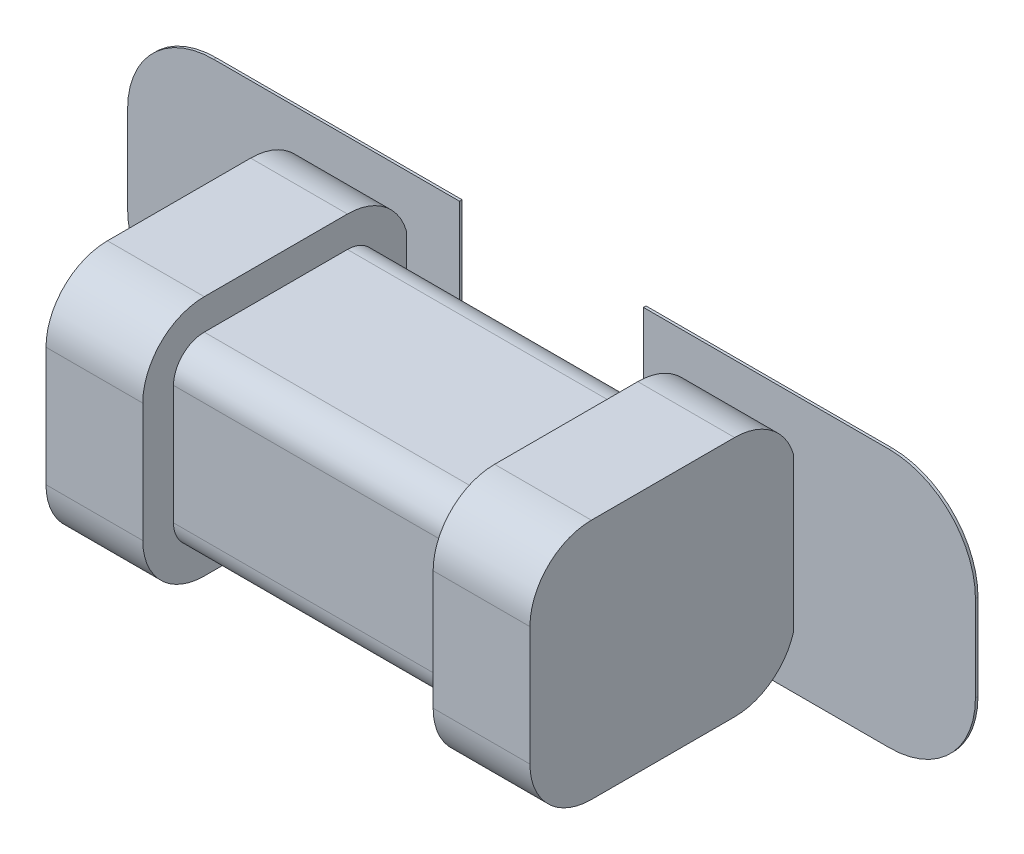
ISO-10303-21;
HEADER;
FILE_DESCRIPTION(('STEP AP214'),'2;1');
FILE_NAME('part.step','',(''),(''),'','','');
FILE_SCHEMA(('AUTOMOTIVE_DESIGN { 1 0 10303 214 1 1 1 1 }'));
ENDSEC;
DATA;
#1=APPLICATION_CONTEXT('core data for automotive mechanical design processes');
#2=APPLICATION_PROTOCOL_DEFINITION('international standard','automotive_design',2000,#1);
#3=PRODUCT_CONTEXT('',#1,'mechanical');
#4=PRODUCT('Part','Part','',(#3));
#5=PRODUCT_RELATED_PRODUCT_CATEGORY('part','',(#4));
#6=PRODUCT_DEFINITION_FORMATION('','',#4);
#7=PRODUCT_DEFINITION_CONTEXT('part definition',#1,'design');
#8=PRODUCT_DEFINITION('design','',#6,#7);
#9=PRODUCT_DEFINITION_SHAPE('','',#8);
#10=(LENGTH_UNIT() NAMED_UNIT(*) SI_UNIT(.MILLI.,.METRE.));
#11=(NAMED_UNIT(*) PLANE_ANGLE_UNIT() SI_UNIT($,.RADIAN.));
#12=(NAMED_UNIT(*) SI_UNIT($,.STERADIAN.) SOLID_ANGLE_UNIT());
#13=UNCERTAINTY_MEASURE_WITH_UNIT(LENGTH_MEASURE(1.E-05),#10,'distance_accuracy_value','');
#14=(GEOMETRIC_REPRESENTATION_CONTEXT(3) GLOBAL_UNCERTAINTY_ASSIGNED_CONTEXT((#13)) GLOBAL_UNIT_ASSIGNED_CONTEXT((#10,
#11,#12)) REPRESENTATION_CONTEXT('',''));
#15=CARTESIAN_POINT('',(0.,0.,0.));
#16=DIRECTION('',(0.,0.,1.));
#17=DIRECTION('',(1.,0.,0.));
#18=AXIS2_PLACEMENT_3D('',#15,#16,#17);
#19=CARTESIAN_POINT('',(0.,0.,0.0762));
#20=DIRECTION('',(0.,0.,1.));
#21=DIRECTION('',(1.,0.,0.));
#22=AXIS2_PLACEMENT_3D('',#19,#20,#21);
#23=PLANE('',#22);
#24=CARTESIAN_POINT('',(-0.698058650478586,-0.0890682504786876,0.0762));
#25=DIRECTION('',(0.,0.,1.));
#26=DIRECTION('',(1.,0.,0.));
#27=AXIS2_PLACEMENT_3D('',#24,#25,#26);
#28=CIRCLE('',#27,0.177936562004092);
#29=CARTESIAN_POINT('',(-0.875995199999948,-0.0890016,0.0762));
#30=VERTEX_POINT('',#29);
#31=CARTESIAN_POINT('',(-0.697992,-0.267004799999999,0.0762));
#32=VERTEX_POINT('',#31);
#33=EDGE_CURVE('E268',#30,#32,#28,.T.);
#34=ORIENTED_EDGE('',*,*,#33,.F.);
#35=DIRECTION('',(0.,1.,0.));
#36=VECTOR('',#35,1.);
#37=CARTESIAN_POINT('',(-0.8759952,0.0890016,0.0762));
#38=LINE('',#37,#36);
#39=CARTESIAN_POINT('',(-0.875995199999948,0.0890016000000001,0.0762));
#40=VERTEX_POINT('',#39);
#41=EDGE_CURVE('E262',#40,#30,#38,.F.);
#42=ORIENTED_EDGE('',*,*,#41,.F.);
#43=CARTESIAN_POINT('',(-0.698058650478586,0.0890682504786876,0.0762));
#44=DIRECTION('',(0.,0.,1.));
#45=DIRECTION('',(1.,0.,0.));
#46=AXIS2_PLACEMENT_3D('',#43,#44,#45);
#47=CIRCLE('',#46,0.177936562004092);
#48=CARTESIAN_POINT('',(-0.697992,0.267004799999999,0.0762));
#49=VERTEX_POINT('',#48);
#50=EDGE_CURVE('E19',#49,#40,#47,.T.);
#51=ORIENTED_EDGE('',*,*,#50,.F.);
#52=DIRECTION('',(1.,0.,0.));
#53=VECTOR('',#52,1.);
#54=CARTESIAN_POINT('',(-0.189992,0.2670048,0.0762));
#55=LINE('',#54,#53);
#56=CARTESIAN_POINT('',(-0.189992,0.2670048,0.0762));
#57=VERTEX_POINT('',#56);
#58=EDGE_CURVE('E245',#57,#49,#55,.F.);
#59=ORIENTED_EDGE('',*,*,#58,.F.);
#60=DIRECTION('',(0.,1.,0.));
#61=VECTOR('',#60,1.);
#62=CARTESIAN_POINT('',(-0.189992,-0.2670048,0.0762));
#63=LINE('',#62,#61);
#64=CARTESIAN_POINT('',(-0.189992,-0.2670048,0.0762));
#65=VERTEX_POINT('',#64);
#66=EDGE_CURVE('E408',#65,#57,#63,.T.);
#67=ORIENTED_EDGE('',*,*,#66,.F.);
#68=DIRECTION('',(1.,0.,0.));
#69=VECTOR('',#68,1.);
#70=CARTESIAN_POINT('',(-0.697992,-0.2670048,0.0762));
#71=LINE('',#70,#69);
#72=EDGE_CURVE('E395',#32,#65,#71,.T.);
#73=ORIENTED_EDGE('',*,*,#72,.F.);
#74=EDGE_LOOP('',(#34,#42,#51,#59,#67,#73));
#75=FACE_BOUND('',#74,.T.);
#76=ADVANCED_FACE('F16',(#75),#23,.F.);
#77=CARTESIAN_POINT('',(-0.189992,0.2670048,0.0762));
#78=DIRECTION('',(0.,1.,0.));
#79=DIRECTION('',(0.,0.,1.));
#80=AXIS2_PLACEMENT_3D('',#77,#78,#79);
#81=PLANE('',#80);
#82=DIRECTION('',(0.,0.,-1.));
#83=VECTOR('',#82,1.);
#84=CARTESIAN_POINT('',(-0.189992,0.2670048,0.0762));
#85=LINE('',#84,#83);
#86=CARTESIAN_POINT('',(-0.189992,0.2670048,0.081534));
#87=VERTEX_POINT('',#86);
#88=EDGE_CURVE('E399',#57,#87,#85,.F.);
#89=ORIENTED_EDGE('',*,*,#88,.F.);
#90=ORIENTED_EDGE('',*,*,#58,.T.);
#91=DIRECTION('',(0.,0.,1.));
#92=VECTOR('',#91,1.);
#93=CARTESIAN_POINT('',(-0.697992,0.267004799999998,0.0762));
#94=LINE('',#93,#92);
#95=CARTESIAN_POINT('',(-0.697992,0.267004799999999,0.081534));
#96=VERTEX_POINT('',#95);
#97=EDGE_CURVE('E256',#96,#49,#94,.F.);
#98=ORIENTED_EDGE('',*,*,#97,.F.);
#99=DIRECTION('',(1.,0.,0.));
#100=VECTOR('',#99,1.);
#101=CARTESIAN_POINT('',(0.,0.2670048,0.081534));
#102=LINE('',#101,#100);
#103=EDGE_CURVE('E390',#87,#96,#102,.F.);
#104=ORIENTED_EDGE('',*,*,#103,.F.);
#105=EDGE_LOOP('',(#89,#90,#98,#104));
#106=FACE_BOUND('',#105,.T.);
#107=ADVANCED_FACE('F457',(#106),#81,.T.);
#108=CARTESIAN_POINT('',(-0.698058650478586,0.0890682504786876,0.0762));
#109=DIRECTION('',(0.,0.,1.));
#110=DIRECTION('',(1.,0.,0.));
#111=AXIS2_PLACEMENT_3D('',#108,#109,#110);
#112=CYLINDRICAL_SURFACE('',#111,0.177936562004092);
#113=ORIENTED_EDGE('',*,*,#97,.T.);
#114=ORIENTED_EDGE('',*,*,#50,.T.);
#115=DIRECTION('',(0.,0.,1.));
#116=VECTOR('',#115,1.);
#117=CARTESIAN_POINT('',(-0.8759952,0.0890016,0.0762));
#118=LINE('',#117,#116);
#119=CARTESIAN_POINT('',(-0.875995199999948,0.0890016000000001,0.081534));
#120=VERTEX_POINT('',#119);
#121=EDGE_CURVE('E254',#120,#40,#118,.F.);
#122=ORIENTED_EDGE('',*,*,#121,.F.);
#123=CARTESIAN_POINT('',(-0.698058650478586,0.0890682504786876,0.081534));
#124=DIRECTION('',(0.,0.,1.));
#125=DIRECTION('',(1.,0.,0.));
#126=AXIS2_PLACEMENT_3D('',#123,#124,#125);
#127=CIRCLE('',#126,0.177936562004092);
#128=EDGE_CURVE('E389',#96,#120,#127,.T.);
#129=ORIENTED_EDGE('',*,*,#128,.F.);
#130=EDGE_LOOP('',(#113,#114,#122,#129));
#131=FACE_BOUND('',#130,.T.);
#132=ADVANCED_FACE('F252',(#131),#112,.T.);
#133=CARTESIAN_POINT('',(-0.8759952,0.0890016,0.0762));
#134=DIRECTION('',(-1.,0.,0.));
#135=DIRECTION('',(0.,0.,1.));
#136=AXIS2_PLACEMENT_3D('',#133,#134,#135);
#137=PLANE('',#136);
#138=ORIENTED_EDGE('',*,*,#121,.T.);
#139=ORIENTED_EDGE('',*,*,#41,.T.);
#140=DIRECTION('',(0.,0.,1.));
#141=VECTOR('',#140,1.);
#142=CARTESIAN_POINT('',(-0.875995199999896,-0.0890016,0.0762));
#143=LINE('',#142,#141);
#144=CARTESIAN_POINT('',(-0.875995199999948,-0.0890016,0.081534));
#145=VERTEX_POINT('',#144);
#146=EDGE_CURVE('E269',#145,#30,#143,.F.);
#147=ORIENTED_EDGE('',*,*,#146,.F.);
#148=DIRECTION('',(0.,1.,0.));
#149=VECTOR('',#148,1.);
#150=CARTESIAN_POINT('',(-0.8759952,0.,0.081534));
#151=LINE('',#150,#149);
#152=EDGE_CURVE('E264',#120,#145,#151,.F.);
#153=ORIENTED_EDGE('',*,*,#152,.F.);
#154=EDGE_LOOP('',(#138,#139,#147,#153));
#155=FACE_BOUND('',#154,.T.);
#156=ADVANCED_FACE('F260',(#155),#137,.T.);
#157=CARTESIAN_POINT('',(-0.698058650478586,-0.0890682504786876,0.0762));
#158=DIRECTION('',(0.,0.,1.));
#159=DIRECTION('',(1.,0.,0.));
#160=AXIS2_PLACEMENT_3D('',#157,#158,#159);
#161=CYLINDRICAL_SURFACE('',#160,0.177936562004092);
#162=ORIENTED_EDGE('',*,*,#146,.T.);
#163=ORIENTED_EDGE('',*,*,#33,.T.);
#164=DIRECTION('',(0.,0.,-1.));
#165=VECTOR('',#164,1.);
#166=CARTESIAN_POINT('',(-0.697992,-0.2670048,0.0762));
#167=LINE('',#166,#165);
#168=CARTESIAN_POINT('',(-0.697992,-0.267004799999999,0.081534));
#169=VERTEX_POINT('',#168);
#170=EDGE_CURVE('E391',#169,#32,#167,.T.);
#171=ORIENTED_EDGE('',*,*,#170,.F.);
#172=CARTESIAN_POINT('',(-0.698058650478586,-0.0890682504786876,0.081534));
#173=DIRECTION('',(0.,0.,1.));
#174=DIRECTION('',(1.,0.,0.));
#175=AXIS2_PLACEMENT_3D('',#172,#173,#174);
#176=CIRCLE('',#175,0.177936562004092);
#177=EDGE_CURVE('E386',#145,#169,#176,.T.);
#178=ORIENTED_EDGE('',*,*,#177,.F.);
#179=EDGE_LOOP('',(#162,#163,#171,#178));
#180=FACE_BOUND('',#179,.T.);
#181=ADVANCED_FACE('F458',(#180),#161,.T.);
#182=CARTESIAN_POINT('',(-0.697992,-0.2670048,0.0762));
#183=DIRECTION('',(0.,-1.,0.));
#184=DIRECTION('',(0.,0.,-1.));
#185=AXIS2_PLACEMENT_3D('',#182,#183,#184);
#186=PLANE('',#185);
#187=ORIENTED_EDGE('',*,*,#170,.T.);
#188=ORIENTED_EDGE('',*,*,#72,.T.);
#189=DIRECTION('',(0.,0.,-1.));
#190=VECTOR('',#189,1.);
#191=CARTESIAN_POINT('',(-0.189992,-0.2670048,0.0762));
#192=LINE('',#191,#190);
#193=CARTESIAN_POINT('',(-0.189992,-0.2670048,0.081534));
#194=VERTEX_POINT('',#193);
#195=EDGE_CURVE('E405',#194,#65,#192,.T.);
#196=ORIENTED_EDGE('',*,*,#195,.F.);
#197=DIRECTION('',(1.,0.,0.));
#198=VECTOR('',#197,1.);
#199=CARTESIAN_POINT('',(0.,-0.2670048,0.081534));
#200=LINE('',#199,#198);
#201=EDGE_CURVE('E388',#169,#194,#200,.T.);
#202=ORIENTED_EDGE('',*,*,#201,.F.);
#203=EDGE_LOOP('',(#187,#188,#196,#202));
#204=FACE_BOUND('',#203,.T.);
#205=ADVANCED_FACE('F455',(#204),#186,.T.);
#206=CARTESIAN_POINT('',(-0.189992,-0.2670048,0.0762));
#207=DIRECTION('',(1.,0.,0.));
#208=DIRECTION('',(0.,0.,-1.));
#209=AXIS2_PLACEMENT_3D('',#206,#207,#208);
#210=PLANE('',#209);
#211=ORIENTED_EDGE('',*,*,#195,.T.);
#212=ORIENTED_EDGE('',*,*,#66,.T.);
#213=ORIENTED_EDGE('',*,*,#88,.T.);
#214=DIRECTION('',(0.,1.,0.));
#215=VECTOR('',#214,1.);
#216=CARTESIAN_POINT('',(-0.189992,0.,0.081534));
#217=LINE('',#216,#215);
#218=EDGE_CURVE('E411',#194,#87,#217,.T.);
#219=ORIENTED_EDGE('',*,*,#218,.F.);
#220=EDGE_LOOP('',(#211,#212,#213,#219));
#221=FACE_BOUND('',#220,.T.);
#222=ADVANCED_FACE('F456',(#221),#210,.T.);
#223=CARTESIAN_POINT('',(-0.500000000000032,0.249999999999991,0.0762));
#224=DIRECTION('',(-1.,0.,0.));
#225=DIRECTION('',(0.,0.,1.));
#226=AXIS2_PLACEMENT_3D('',#223,#224,#225);
#227=PLANE('',#226);
#228=CARTESIAN_POINT('',(-0.500000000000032,0.122999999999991,0.2032));
#229=DIRECTION('',(1.,0.,0.));
#230=DIRECTION('',(0.,0.,-1.));
#231=AXIS2_PLACEMENT_3D('',#228,#229,#230);
#232=CIRCLE('',#231,0.127);
#233=CARTESIAN_POINT('',(-0.500000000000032,0.15941956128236,0.0815340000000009));
#234=VERTEX_POINT('',#233);
#235=CARTESIAN_POINT('',(-0.500000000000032,0.249999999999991,0.2032));
#236=VERTEX_POINT('',#235);
#237=EDGE_CURVE('E369',#234,#236,#232,.T.);
#238=ORIENTED_EDGE('',*,*,#237,.F.);
#239=DIRECTION('',(0.,1.,0.));
#240=VECTOR('',#239,1.);
#241=CARTESIAN_POINT('',(-0.500000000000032,0.,0.081534));
#242=LINE('',#241,#240);
#243=CARTESIAN_POINT('',(-0.500000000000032,-0.15941956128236,0.0815340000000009));
#244=VERTEX_POINT('',#243);
#245=EDGE_CURVE('E385',#244,#234,#242,.T.);
#246=ORIENTED_EDGE('',*,*,#245,.F.);
#247=CARTESIAN_POINT('',(-0.500000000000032,-0.122999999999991,0.2032));
#248=DIRECTION('',(1.,0.,0.));
#249=DIRECTION('',(0.,0.,-1.));
#250=AXIS2_PLACEMENT_3D('',#247,#248,#249);
#251=CIRCLE('',#250,0.127);
#252=CARTESIAN_POINT('',(-0.500000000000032,-0.249999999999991,0.2032));
#253=VERTEX_POINT('',#252);
#254=EDGE_CURVE('E382',#253,#244,#251,.T.);
#255=ORIENTED_EDGE('',*,*,#254,.F.);
#256=DIRECTION('',(0.,0.,-1.));
#257=VECTOR('',#256,1.);
#258=CARTESIAN_POINT('',(-0.500000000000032,-0.249999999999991,0.0762));
#259=LINE('',#258,#257);
#260=CARTESIAN_POINT('',(-0.500000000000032,-0.249999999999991,0.49911));
#261=VERTEX_POINT('',#260);
#262=EDGE_CURVE('E403',#261,#253,#259,.T.);
#263=ORIENTED_EDGE('',*,*,#262,.F.);
#264=CARTESIAN_POINT('',(-0.500000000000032,-0.122999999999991,0.49911));
#265=DIRECTION('',(1.,0.,0.));
#266=DIRECTION('',(0.,0.,-1.));
#267=AXIS2_PLACEMENT_3D('',#264,#265,#266);
#268=CIRCLE('',#267,0.127);
#269=CARTESIAN_POINT('',(-0.500000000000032,-0.122999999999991,0.62611));
#270=VERTEX_POINT('',#269);
#271=EDGE_CURVE('E378',#270,#261,#268,.T.);
#272=ORIENTED_EDGE('',*,*,#271,.F.);
#273=DIRECTION('',(0.,1.,0.));
#274=VECTOR('',#273,1.);
#275=CARTESIAN_POINT('',(-0.500000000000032,0.,0.62611));
#276=LINE('',#275,#274);
#277=CARTESIAN_POINT('',(-0.500000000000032,0.122999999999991,0.62611));
#278=VERTEX_POINT('',#277);
#279=EDGE_CURVE('E436',#278,#270,#276,.F.);
#280=ORIENTED_EDGE('',*,*,#279,.F.);
#281=CARTESIAN_POINT('',(-0.500000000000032,0.122999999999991,0.49911));
#282=DIRECTION('',(-1.,0.,0.));
#283=DIRECTION('',(0.,0.,1.));
#284=AXIS2_PLACEMENT_3D('',#281,#282,#283);
#285=CIRCLE('',#284,0.127);
#286=CARTESIAN_POINT('',(-0.500000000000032,0.249999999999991,0.49911));
#287=VERTEX_POINT('',#286);
#288=EDGE_CURVE('E373',#287,#278,#285,.F.);
#289=ORIENTED_EDGE('',*,*,#288,.F.);
#290=DIRECTION('',(0.,0.,1.));
#291=VECTOR('',#290,1.);
#292=CARTESIAN_POINT('',(-0.500000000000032,0.249999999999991,0.0762));
#293=LINE('',#292,#291);
#294=EDGE_CURVE('E376',#236,#287,#293,.T.);
#295=ORIENTED_EDGE('',*,*,#294,.F.);
#296=EDGE_LOOP('',(#238,#246,#255,#263,#272,#280,#289,#295));
#297=FACE_BOUND('',#296,.T.);
#298=ADVANCED_FACE('F603',(#297),#227,.T.);
#299=CARTESIAN_POINT('',(0.,0.,0.081534));
#300=DIRECTION('',(0.,0.,1.));
#301=DIRECTION('',(1.,0.,0.));
#302=AXIS2_PLACEMENT_3D('',#299,#300,#301);
#303=PLANE('',#302);
#304=DIRECTION('',(1.,0.,0.));
#305=VECTOR('',#304,1.);
#306=CARTESIAN_POINT('',(0.500000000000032,-0.159419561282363,0.0815340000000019));
#307=LINE('',#306,#305);
#308=CARTESIAN_POINT('',(-0.30000000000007,-0.15941956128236,0.0815340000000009));
#309=VERTEX_POINT('',#308);
#310=EDGE_CURVE('E384',#244,#309,#307,.T.);
#311=ORIENTED_EDGE('',*,*,#310,.F.);
#312=ORIENTED_EDGE('',*,*,#245,.T.);
#313=DIRECTION('',(1.,0.,0.));
#314=VECTOR('',#313,1.);
#315=CARTESIAN_POINT('',(0.500000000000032,0.159419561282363,0.0815340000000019));
#316=LINE('',#315,#314);
#317=CARTESIAN_POINT('',(-0.30000000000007,0.15941956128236,0.0815340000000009));
#318=VERTEX_POINT('',#317);
#319=EDGE_CURVE('E950',#318,#234,#316,.F.);
#320=ORIENTED_EDGE('',*,*,#319,.F.);
#321=DIRECTION('',(0.,1.,0.));
#322=VECTOR('',#321,1.);
#323=CARTESIAN_POINT('',(-0.30000000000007,0.249999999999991,0.081534));
#324=LINE('',#323,#322);
#325=EDGE_CURVE('E368',#318,#309,#324,.F.);
#326=ORIENTED_EDGE('',*,*,#325,.T.);
#327=EDGE_LOOP('',(#311,#312,#320,#326));
#328=FACE_BOUND('',#327,.T.);
#329=ORIENTED_EDGE('',*,*,#201,.T.);
#330=ORIENTED_EDGE('',*,*,#218,.T.);
#331=ORIENTED_EDGE('',*,*,#103,.T.);
#332=ORIENTED_EDGE('',*,*,#128,.T.);
#333=ORIENTED_EDGE('',*,*,#152,.T.);
#334=ORIENTED_EDGE('',*,*,#177,.T.);
#335=EDGE_LOOP('',(#329,#330,#331,#332,#333,#334));
#336=FACE_BOUND('',#335,.T.);
#337=ADVANCED_FACE('F452',(#328,#336),#303,.T.);
#338=CARTESIAN_POINT('',(0.500000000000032,-0.122999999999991,0.2032));
#339=DIRECTION('',(1.,0.,0.));
#340=DIRECTION('',(0.,0.,-1.));
#341=AXIS2_PLACEMENT_3D('',#338,#339,#340);
#342=CYLINDRICAL_SURFACE('',#341,0.127);
#343=ORIENTED_EDGE('',*,*,#254,.T.);
#344=ORIENTED_EDGE('',*,*,#310,.T.);
#345=CARTESIAN_POINT('',(-0.30000000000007,-0.122999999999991,0.2032));
#346=DIRECTION('',(1.,0.,0.));
#347=DIRECTION('',(0.,0.,-1.));
#348=AXIS2_PLACEMENT_3D('',#345,#346,#347);
#349=CIRCLE('',#348,0.127);
#350=CARTESIAN_POINT('',(-0.30000000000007,-0.249999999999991,0.2032));
#351=VERTEX_POINT('',#350);
#352=EDGE_CURVE('E365',#309,#351,#349,.F.);
#353=ORIENTED_EDGE('',*,*,#352,.T.);
#354=DIRECTION('',(1.,0.,0.));
#355=VECTOR('',#354,1.);
#356=CARTESIAN_POINT('',(-0.500000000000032,-0.249999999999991,0.2032));
#357=LINE('',#356,#355);
#358=EDGE_CURVE('E381',#253,#351,#357,.T.);
#359=ORIENTED_EDGE('',*,*,#358,.F.);
#360=EDGE_LOOP('',(#343,#344,#353,#359));
#361=FACE_BOUND('',#360,.T.);
#362=ADVANCED_FACE('F596',(#361),#342,.T.);
#363=CARTESIAN_POINT('',(-0.500000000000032,-0.249999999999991,0.0762));
#364=DIRECTION('',(0.,-1.,0.));
#365=DIRECTION('',(0.,0.,-1.));
#366=AXIS2_PLACEMENT_3D('',#363,#364,#365);
#367=PLANE('',#366);
#368=ORIENTED_EDGE('',*,*,#262,.T.);
#369=ORIENTED_EDGE('',*,*,#358,.T.);
#370=DIRECTION('',(0.,0.,1.));
#371=VECTOR('',#370,1.);
#372=CARTESIAN_POINT('',(-0.30000000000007,-0.249999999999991,0.0762));
#373=LINE('',#372,#371);
#374=CARTESIAN_POINT('',(-0.30000000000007,-0.249999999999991,0.49911));
#375=VERTEX_POINT('',#374);
#376=EDGE_CURVE('E364',#351,#375,#373,.T.);
#377=ORIENTED_EDGE('',*,*,#376,.T.);
#378=DIRECTION('',(1.,0.,0.));
#379=VECTOR('',#378,1.);
#380=CARTESIAN_POINT('',(-0.503674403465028,-0.249999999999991,0.49911));
#381=LINE('',#380,#379);
#382=EDGE_CURVE('E380',#261,#375,#381,.T.);
#383=ORIENTED_EDGE('',*,*,#382,.F.);
#384=EDGE_LOOP('',(#368,#369,#377,#383));
#385=FACE_BOUND('',#384,.T.);
#386=ADVANCED_FACE('F593',(#385),#367,.T.);
#387=CARTESIAN_POINT('',(-0.503674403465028,-0.122999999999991,0.49911));
#388=DIRECTION('',(1.,0.,0.));
#389=DIRECTION('',(0.,0.,-1.));
#390=AXIS2_PLACEMENT_3D('',#387,#388,#389);
#391=CYLINDRICAL_SURFACE('',#390,0.127);
#392=ORIENTED_EDGE('',*,*,#382,.T.);
#393=CARTESIAN_POINT('',(-0.30000000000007,-0.122999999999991,0.49911));
#394=DIRECTION('',(1.,0.,0.));
#395=DIRECTION('',(0.,0.,-1.));
#396=AXIS2_PLACEMENT_3D('',#393,#394,#395);
#397=CIRCLE('',#396,0.127);
#398=CARTESIAN_POINT('',(-0.30000000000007,-0.122999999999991,0.62611));
#399=VERTEX_POINT('',#398);
#400=EDGE_CURVE('E361',#375,#399,#397,.F.);
#401=ORIENTED_EDGE('',*,*,#400,.T.);
#402=DIRECTION('',(1.,0.,0.));
#403=VECTOR('',#402,1.);
#404=CARTESIAN_POINT('',(0.,-0.122999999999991,0.62611));
#405=LINE('',#404,#403);
#406=EDGE_CURVE('E437',#270,#399,#405,.T.);
#407=ORIENTED_EDGE('',*,*,#406,.F.);
#408=ORIENTED_EDGE('',*,*,#271,.T.);
#409=EDGE_LOOP('',(#392,#401,#407,#408));
#410=FACE_BOUND('',#409,.T.);
#411=ADVANCED_FACE('F590',(#410),#391,.T.);
#412=CARTESIAN_POINT('',(0.,0.,0.62611));
#413=DIRECTION('',(0.,0.,1.));
#414=DIRECTION('',(1.,0.,0.));
#415=AXIS2_PLACEMENT_3D('',#412,#413,#414);
#416=PLANE('',#415);
#417=DIRECTION('',(0.,1.,0.));
#418=VECTOR('',#417,1.);
#419=CARTESIAN_POINT('',(-0.30000000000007,0.249999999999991,0.62611));
#420=LINE('',#419,#418);
#421=CARTESIAN_POINT('',(-0.30000000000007,0.122999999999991,0.62611));
#422=VERTEX_POINT('',#421);
#423=EDGE_CURVE('E360',#399,#422,#420,.T.);
#424=ORIENTED_EDGE('',*,*,#423,.T.);
#425=DIRECTION('',(-1.,0.,0.));
#426=VECTOR('',#425,1.);
#427=CARTESIAN_POINT('',(0.503533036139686,0.122999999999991,0.62611));
#428=LINE('',#427,#426);
#429=EDGE_CURVE('E377',#278,#422,#428,.F.);
#430=ORIENTED_EDGE('',*,*,#429,.F.);
#431=ORIENTED_EDGE('',*,*,#279,.T.);
#432=ORIENTED_EDGE('',*,*,#406,.T.);
#433=EDGE_LOOP('',(#424,#430,#431,#432));
#434=FACE_BOUND('',#433,.T.);
#435=ADVANCED_FACE('F586',(#434),#416,.T.);
#436=CARTESIAN_POINT('',(0.503533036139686,0.122999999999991,0.49911));
#437=DIRECTION('',(-1.,0.,0.));
#438=DIRECTION('',(0.,0.,1.));
#439=AXIS2_PLACEMENT_3D('',#436,#437,#438);
#440=CYLINDRICAL_SURFACE('',#439,0.127);
#441=DIRECTION('',(1.,0.,0.));
#442=VECTOR('',#441,1.);
#443=CARTESIAN_POINT('',(0.500000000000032,0.249999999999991,0.49911));
#444=LINE('',#443,#442);
#445=CARTESIAN_POINT('',(-0.30000000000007,0.249999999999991,0.49911));
#446=VERTEX_POINT('',#445);
#447=EDGE_CURVE('E372',#287,#446,#444,.T.);
#448=ORIENTED_EDGE('',*,*,#447,.F.);
#449=ORIENTED_EDGE('',*,*,#288,.T.);
#450=ORIENTED_EDGE('',*,*,#429,.T.);
#451=CARTESIAN_POINT('',(-0.30000000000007,0.122999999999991,0.49911));
#452=DIRECTION('',(-1.,0.,0.));
#453=DIRECTION('',(0.,0.,1.));
#454=AXIS2_PLACEMENT_3D('',#451,#452,#453);
#455=CIRCLE('',#454,0.127);
#456=EDGE_CURVE('E357',#422,#446,#455,.T.);
#457=ORIENTED_EDGE('',*,*,#456,.T.);
#458=EDGE_LOOP('',(#448,#449,#450,#457));
#459=FACE_BOUND('',#458,.T.);
#460=ADVANCED_FACE('F582',(#459),#440,.T.);
#461=CARTESIAN_POINT('',(0.500000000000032,0.249999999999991,0.0762));
#462=DIRECTION('',(0.,1.,0.));
#463=DIRECTION('',(0.,0.,1.));
#464=AXIS2_PLACEMENT_3D('',#461,#462,#463);
#465=PLANE('',#464);
#466=DIRECTION('',(0.,0.,1.));
#467=VECTOR('',#466,1.);
#468=CARTESIAN_POINT('',(-0.30000000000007,0.249999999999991,0.0762));
#469=LINE('',#468,#467);
#470=CARTESIAN_POINT('',(-0.30000000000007,0.249999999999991,0.2032));
#471=VERTEX_POINT('',#470);
#472=EDGE_CURVE('E356',#446,#471,#469,.F.);
#473=ORIENTED_EDGE('',*,*,#472,.T.);
#474=DIRECTION('',(1.,0.,0.));
#475=VECTOR('',#474,1.);
#476=CARTESIAN_POINT('',(0.500000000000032,0.249999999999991,0.2032));
#477=LINE('',#476,#475);
#478=EDGE_CURVE('E371',#236,#471,#477,.T.);
#479=ORIENTED_EDGE('',*,*,#478,.F.);
#480=ORIENTED_EDGE('',*,*,#294,.T.);
#481=ORIENTED_EDGE('',*,*,#447,.T.);
#482=EDGE_LOOP('',(#473,#479,#480,#481));
#483=FACE_BOUND('',#482,.T.);
#484=ADVANCED_FACE('F578',(#483),#465,.T.);
#485=CARTESIAN_POINT('',(0.500000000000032,0.122999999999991,0.2032));
#486=DIRECTION('',(1.,0.,0.));
#487=DIRECTION('',(0.,0.,-1.));
#488=AXIS2_PLACEMENT_3D('',#485,#486,#487);
#489=CYLINDRICAL_SURFACE('',#488,0.127);
#490=CARTESIAN_POINT('',(-0.30000000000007,0.122999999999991,0.2032));
#491=DIRECTION('',(1.,0.,0.));
#492=DIRECTION('',(0.,0.,-1.));
#493=AXIS2_PLACEMENT_3D('',#490,#491,#492);
#494=CIRCLE('',#493,0.127);
#495=EDGE_CURVE('E353',#471,#318,#494,.F.);
#496=ORIENTED_EDGE('',*,*,#495,.T.);
#497=ORIENTED_EDGE('',*,*,#319,.T.);
#498=ORIENTED_EDGE('',*,*,#237,.T.);
#499=ORIENTED_EDGE('',*,*,#478,.T.);
#500=EDGE_LOOP('',(#496,#497,#498,#499));
#501=FACE_BOUND('',#500,.T.);
#502=ADVANCED_FACE('F574',(#501),#489,.T.);
#503=CARTESIAN_POINT('',(-0.30000000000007,0.249999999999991,0.0762));
#504=DIRECTION('',(-1.,0.,0.));
#505=DIRECTION('',(0.,0.,1.));
#506=AXIS2_PLACEMENT_3D('',#503,#504,#505);
#507=PLANE('',#506);
#508=DIRECTION('',(0.,1.,0.));
#509=VECTOR('',#508,1.);
#510=CARTESIAN_POINT('',(-0.30000000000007,0.249999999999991,0.1397));
#511=LINE('',#510,#509);
#512=CARTESIAN_POINT('',(-0.30000000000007,0.122999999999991,0.1397));
#513=VERTEX_POINT('',#512);
#514=CARTESIAN_POINT('',(-0.30000000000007,-0.122999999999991,0.1397));
#515=VERTEX_POINT('',#514);
#516=EDGE_CURVE('E344',#513,#515,#511,.F.);
#517=ORIENTED_EDGE('',*,*,#516,.T.);
#518=CARTESIAN_POINT('',(-0.30000000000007,-0.122999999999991,0.2032));
#519=DIRECTION('',(1.,0.,0.));
#520=DIRECTION('',(0.,0.,-1.));
#521=AXIS2_PLACEMENT_3D('',#518,#519,#520);
#522=CIRCLE('',#521,0.0635);
#523=CARTESIAN_POINT('',(-0.30000000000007,-0.186499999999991,0.2032));
#524=VERTEX_POINT('',#523);
#525=EDGE_CURVE('E341',#524,#515,#522,.T.);
#526=ORIENTED_EDGE('',*,*,#525,.F.);
#527=DIRECTION('',(0.,0.,1.));
#528=VECTOR('',#527,1.);
#529=CARTESIAN_POINT('',(-0.30000000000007,-0.186499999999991,0.0762));
#530=LINE('',#529,#528);
#531=CARTESIAN_POINT('',(-0.30000000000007,-0.186499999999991,0.49911));
#532=VERTEX_POINT('',#531);
#533=EDGE_CURVE('E340',#524,#532,#530,.T.);
#534=ORIENTED_EDGE('',*,*,#533,.T.);
#535=CARTESIAN_POINT('',(-0.30000000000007,-0.122999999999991,0.49911));
#536=DIRECTION('',(-1.,0.,0.));
#537=DIRECTION('',(0.,0.,1.));
#538=AXIS2_PLACEMENT_3D('',#535,#536,#537);
#539=CIRCLE('',#538,0.0635);
#540=CARTESIAN_POINT('',(-0.30000000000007,-0.122999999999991,0.56261));
#541=VERTEX_POINT('',#540);
#542=EDGE_CURVE('E337',#541,#532,#539,.F.);
#543=ORIENTED_EDGE('',*,*,#542,.F.);
#544=DIRECTION('',(0.,1.,0.));
#545=VECTOR('',#544,1.);
#546=CARTESIAN_POINT('',(-0.30000000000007,0.249999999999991,0.56261));
#547=LINE('',#546,#545);
#548=CARTESIAN_POINT('',(-0.30000000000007,0.122999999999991,0.56261));
#549=VERTEX_POINT('',#548);
#550=EDGE_CURVE('E352',#541,#549,#547,.T.);
#551=ORIENTED_EDGE('',*,*,#550,.T.);
#552=CARTESIAN_POINT('',(-0.30000000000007,0.122999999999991,0.49911));
#553=DIRECTION('',(1.,0.,0.));
#554=DIRECTION('',(0.,0.,-1.));
#555=AXIS2_PLACEMENT_3D('',#552,#553,#554);
#556=CIRCLE('',#555,0.0635);
#557=CARTESIAN_POINT('',(-0.30000000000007,0.186499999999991,0.49911));
#558=VERTEX_POINT('',#557);
#559=EDGE_CURVE('E349',#558,#549,#556,.T.);
#560=ORIENTED_EDGE('',*,*,#559,.F.);
#561=DIRECTION('',(0.,0.,-1.));
#562=VECTOR('',#561,1.);
#563=CARTESIAN_POINT('',(-0.30000000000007,0.186499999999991,0.0762));
#564=LINE('',#563,#562);
#565=CARTESIAN_POINT('',(-0.30000000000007,0.186499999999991,0.2032));
#566=VERTEX_POINT('',#565);
#567=EDGE_CURVE('E348',#558,#566,#564,.T.);
#568=ORIENTED_EDGE('',*,*,#567,.T.);
#569=CARTESIAN_POINT('',(-0.30000000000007,0.122999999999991,0.2032));
#570=DIRECTION('',(-1.,0.,0.));
#571=DIRECTION('',(0.,0.,1.));
#572=AXIS2_PLACEMENT_3D('',#569,#570,#571);
#573=CIRCLE('',#572,0.0635);
#574=EDGE_CURVE('E345',#513,#566,#573,.F.);
#575=ORIENTED_EDGE('',*,*,#574,.F.);
#576=EDGE_LOOP('',(#517,#526,#534,#543,#551,#560,#568,#575));
#577=FACE_BOUND('',#576,.T.);
#578=ORIENTED_EDGE('',*,*,#472,.F.);
#579=ORIENTED_EDGE('',*,*,#456,.F.);
#580=ORIENTED_EDGE('',*,*,#423,.F.);
#581=ORIENTED_EDGE('',*,*,#400,.F.);
#582=ORIENTED_EDGE('',*,*,#376,.F.);
#583=ORIENTED_EDGE('',*,*,#352,.F.);
#584=ORIENTED_EDGE('',*,*,#325,.F.);
#585=ORIENTED_EDGE('',*,*,#495,.F.);
#586=EDGE_LOOP('',(#578,#579,#580,#581,#582,#583,#584,#585));
#587=FACE_BOUND('',#586,.T.);
#588=ADVANCED_FACE('F570',(#577,#587),#507,.F.);
#589=CARTESIAN_POINT('',(0.30000000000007,0.249999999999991,0.56261));
#590=DIRECTION('',(0.,0.,-1.));
#591=DIRECTION('',(-1.,0.,0.));
#592=AXIS2_PLACEMENT_3D('',#589,#590,#591);
#593=PLANE('',#592);
#594=DIRECTION('',(-1.,0.,0.));
#595=VECTOR('',#594,1.);
#596=CARTESIAN_POINT('',(0.303674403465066,-0.122999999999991,0.56261));
#597=LINE('',#596,#595);
#598=CARTESIAN_POINT('',(0.30000000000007,-0.122999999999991,0.56261));
#599=VERTEX_POINT('',#598);
#600=EDGE_CURVE('E993',#599,#541,#597,.T.);
#601=ORIENTED_EDGE('',*,*,#600,.F.);
#602=DIRECTION('',(0.,1.,0.));
#603=VECTOR('',#602,1.);
#604=CARTESIAN_POINT('',(0.30000000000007,0.186499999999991,0.56261));
#605=LINE('',#604,#603);
#606=CARTESIAN_POINT('',(0.30000000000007,0.122999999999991,0.56261));
#607=VERTEX_POINT('',#606);
#608=EDGE_CURVE('E324',#599,#607,#605,.T.);
#609=ORIENTED_EDGE('',*,*,#608,.T.);
#610=DIRECTION('',(1.,0.,0.));
#611=VECTOR('',#610,1.);
#612=CARTESIAN_POINT('',(-0.30385161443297,0.122999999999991,0.56261));
#613=LINE('',#612,#611);
#614=EDGE_CURVE('E351',#549,#607,#613,.T.);
#615=ORIENTED_EDGE('',*,*,#614,.F.);
#616=ORIENTED_EDGE('',*,*,#550,.F.);
#617=EDGE_LOOP('',(#601,#609,#615,#616));
#618=FACE_BOUND('',#617,.T.);
#619=ADVANCED_FACE('F566',(#618),#593,.F.);
#620=CARTESIAN_POINT('',(-0.30385161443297,0.122999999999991,0.49911));
#621=DIRECTION('',(1.,0.,0.));
#622=DIRECTION('',(0.,0.,-1.));
#623=AXIS2_PLACEMENT_3D('',#620,#621,#622);
#624=CYLINDRICAL_SURFACE('',#623,0.0635);
#625=ORIENTED_EDGE('',*,*,#559,.T.);
#626=ORIENTED_EDGE('',*,*,#614,.T.);
#627=CARTESIAN_POINT('',(0.30000000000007,0.122999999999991,0.49911));
#628=DIRECTION('',(1.,0.,0.));
#629=DIRECTION('',(0.,0.,-1.));
#630=AXIS2_PLACEMENT_3D('',#627,#628,#629);
#631=CIRCLE('',#630,0.0635);
#632=CARTESIAN_POINT('',(0.30000000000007,0.186499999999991,0.49911));
#633=VERTEX_POINT('',#632);
#634=EDGE_CURVE('E321',#607,#633,#631,.F.);
#635=ORIENTED_EDGE('',*,*,#634,.T.);
#636=DIRECTION('',(1.,0.,0.));
#637=VECTOR('',#636,1.);
#638=CARTESIAN_POINT('',(-0.30000000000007,0.186499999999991,0.49911));
#639=LINE('',#638,#637);
#640=EDGE_CURVE('E974',#633,#558,#639,.F.);
#641=ORIENTED_EDGE('',*,*,#640,.T.);
#642=EDGE_LOOP('',(#625,#626,#635,#641));
#643=FACE_BOUND('',#642,.T.);
#644=ADVANCED_FACE('F562',(#643),#624,.T.);
#645=CARTESIAN_POINT('',(-0.30000000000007,0.186499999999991,0.0762));
#646=DIRECTION('',(0.,-1.,0.));
#647=DIRECTION('',(0.,0.,-1.));
#648=AXIS2_PLACEMENT_3D('',#645,#646,#647);
#649=PLANE('',#648);
#650=ORIENTED_EDGE('',*,*,#640,.F.);
#651=DIRECTION('',(0.,0.,-1.));
#652=VECTOR('',#651,1.);
#653=CARTESIAN_POINT('',(0.30000000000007,0.186499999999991,0.0762));
#654=LINE('',#653,#652);
#655=CARTESIAN_POINT('',(0.30000000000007,0.186499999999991,0.2032));
#656=VERTEX_POINT('',#655);
#657=EDGE_CURVE('E320',#633,#656,#654,.T.);
#658=ORIENTED_EDGE('',*,*,#657,.T.);
#659=DIRECTION('',(-1.,0.,0.));
#660=VECTOR('',#659,1.);
#661=CARTESIAN_POINT('',(0.303533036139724,0.186499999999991,0.2032));
#662=LINE('',#661,#660);
#663=EDGE_CURVE('E347',#566,#656,#662,.F.);
#664=ORIENTED_EDGE('',*,*,#663,.F.);
#665=ORIENTED_EDGE('',*,*,#567,.F.);
#666=EDGE_LOOP('',(#650,#658,#664,#665));
#667=FACE_BOUND('',#666,.T.);
#668=ADVANCED_FACE('F558',(#667),#649,.F.);
#669=CARTESIAN_POINT('',(0.303533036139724,0.122999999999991,0.2032));
#670=DIRECTION('',(-1.,0.,0.));
#671=DIRECTION('',(0.,0.,1.));
#672=AXIS2_PLACEMENT_3D('',#669,#670,#671);
#673=CYLINDRICAL_SURFACE('',#672,0.0635);
#674=CARTESIAN_POINT('',(0.30000000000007,0.122999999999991,0.2032));
#675=DIRECTION('',(-1.,0.,0.));
#676=DIRECTION('',(0.,0.,1.));
#677=AXIS2_PLACEMENT_3D('',#674,#675,#676);
#678=CIRCLE('',#677,0.0635);
#679=CARTESIAN_POINT('',(0.30000000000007,0.122999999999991,0.1397));
#680=VERTEX_POINT('',#679);
#681=EDGE_CURVE('E317',#656,#680,#678,.T.);
#682=ORIENTED_EDGE('',*,*,#681,.T.);
#683=DIRECTION('',(1.,0.,0.));
#684=VECTOR('',#683,1.);
#685=CARTESIAN_POINT('',(-0.30000000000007,0.122999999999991,0.1397));
#686=LINE('',#685,#684);
#687=EDGE_CURVE('E972',#680,#513,#686,.F.);
#688=ORIENTED_EDGE('',*,*,#687,.T.);
#689=ORIENTED_EDGE('',*,*,#574,.T.);
#690=ORIENTED_EDGE('',*,*,#663,.T.);
#691=EDGE_LOOP('',(#682,#688,#689,#690));
#692=FACE_BOUND('',#691,.T.);
#693=ADVANCED_FACE('F554',(#692),#673,.T.);
#694=CARTESIAN_POINT('',(-0.30000000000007,0.249999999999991,0.1397));
#695=DIRECTION('',(0.,0.,1.));
#696=DIRECTION('',(1.,0.,0.));
#697=AXIS2_PLACEMENT_3D('',#694,#695,#696);
#698=PLANE('',#697);
#699=DIRECTION('',(1.,0.,0.));
#700=VECTOR('',#699,1.);
#701=CARTESIAN_POINT('',(-0.303533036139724,-0.122999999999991,0.1397));
#702=LINE('',#701,#700);
#703=CARTESIAN_POINT('',(0.30000000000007,-0.122999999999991,0.1397));
#704=VERTEX_POINT('',#703);
#705=EDGE_CURVE('E343',#515,#704,#702,.T.);
#706=ORIENTED_EDGE('',*,*,#705,.F.);
#707=ORIENTED_EDGE('',*,*,#516,.F.);
#708=ORIENTED_EDGE('',*,*,#687,.F.);
#709=DIRECTION('',(0.,1.,0.));
#710=VECTOR('',#709,1.);
#711=CARTESIAN_POINT('',(0.30000000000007,0.186499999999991,0.1397));
#712=LINE('',#711,#710);
#713=EDGE_CURVE('E316',#680,#704,#712,.F.);
#714=ORIENTED_EDGE('',*,*,#713,.T.);
#715=EDGE_LOOP('',(#706,#707,#708,#714));
#716=FACE_BOUND('',#715,.T.);
#717=ADVANCED_FACE('F550',(#716),#698,.F.);
#718=CARTESIAN_POINT('',(-0.303533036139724,-0.122999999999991,0.2032));
#719=DIRECTION('',(1.,0.,0.));
#720=DIRECTION('',(0.,0.,-1.));
#721=AXIS2_PLACEMENT_3D('',#718,#719,#720);
#722=CYLINDRICAL_SURFACE('',#721,0.0635);
#723=ORIENTED_EDGE('',*,*,#525,.T.);
#724=ORIENTED_EDGE('',*,*,#705,.T.);
#725=CARTESIAN_POINT('',(0.30000000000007,-0.122999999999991,0.2032));
#726=DIRECTION('',(1.,0.,0.));
#727=DIRECTION('',(0.,0.,-1.));
#728=AXIS2_PLACEMENT_3D('',#725,#726,#727);
#729=CIRCLE('',#728,0.0635);
#730=CARTESIAN_POINT('',(0.30000000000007,-0.186499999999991,0.2032));
#731=VERTEX_POINT('',#730);
#732=EDGE_CURVE('E313',#704,#731,#729,.F.);
#733=ORIENTED_EDGE('',*,*,#732,.T.);
#734=DIRECTION('',(1.,0.,0.));
#735=VECTOR('',#734,1.);
#736=CARTESIAN_POINT('',(0.30000000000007,-0.186499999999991,0.2032));
#737=LINE('',#736,#735);
#738=EDGE_CURVE('E985',#731,#524,#737,.F.);
#739=ORIENTED_EDGE('',*,*,#738,.T.);
#740=EDGE_LOOP('',(#723,#724,#733,#739));
#741=FACE_BOUND('',#740,.T.);
#742=ADVANCED_FACE('F546',(#741),#722,.T.);
#743=CARTESIAN_POINT('',(0.30000000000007,-0.186499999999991,0.0762));
#744=DIRECTION('',(0.,1.,0.));
#745=DIRECTION('',(0.,0.,1.));
#746=AXIS2_PLACEMENT_3D('',#743,#744,#745);
#747=PLANE('',#746);
#748=ORIENTED_EDGE('',*,*,#738,.F.);
#749=DIRECTION('',(0.,0.,-1.));
#750=VECTOR('',#749,1.);
#751=CARTESIAN_POINT('',(0.30000000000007,-0.186499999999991,0.0762));
#752=LINE('',#751,#750);
#753=CARTESIAN_POINT('',(0.30000000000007,-0.186499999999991,0.49911));
#754=VERTEX_POINT('',#753);
#755=EDGE_CURVE('E312',#731,#754,#752,.F.);
#756=ORIENTED_EDGE('',*,*,#755,.T.);
#757=DIRECTION('',(-1.,0.,0.));
#758=VECTOR('',#757,1.);
#759=CARTESIAN_POINT('',(0.303674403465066,-0.186499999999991,0.49911));
#760=LINE('',#759,#758);
#761=EDGE_CURVE('E339',#532,#754,#760,.F.);
#762=ORIENTED_EDGE('',*,*,#761,.F.);
#763=ORIENTED_EDGE('',*,*,#533,.F.);
#764=EDGE_LOOP('',(#748,#756,#762,#763));
#765=FACE_BOUND('',#764,.T.);
#766=ADVANCED_FACE('F542',(#765),#747,.F.);
#767=CARTESIAN_POINT('',(0.303674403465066,-0.122999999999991,0.49911));
#768=DIRECTION('',(-1.,0.,0.));
#769=DIRECTION('',(0.,0.,1.));
#770=AXIS2_PLACEMENT_3D('',#767,#768,#769);
#771=CYLINDRICAL_SURFACE('',#770,0.0635);
#772=CARTESIAN_POINT('',(0.30000000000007,-0.122999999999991,0.49911));
#773=DIRECTION('',(-1.,0.,0.));
#774=DIRECTION('',(0.,0.,1.));
#775=AXIS2_PLACEMENT_3D('',#772,#773,#774);
#776=CIRCLE('',#775,0.0635);
#777=EDGE_CURVE('E309',#754,#599,#776,.T.);
#778=ORIENTED_EDGE('',*,*,#777,.T.);
#779=ORIENTED_EDGE('',*,*,#600,.T.);
#780=ORIENTED_EDGE('',*,*,#542,.T.);
#781=ORIENTED_EDGE('',*,*,#761,.T.);
#782=EDGE_LOOP('',(#778,#779,#780,#781));
#783=FACE_BOUND('',#782,.T.);
#784=ADVANCED_FACE('F538',(#783),#771,.T.);
#785=CARTESIAN_POINT('',(0.500000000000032,0.249999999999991,0.0762));
#786=DIRECTION('',(0.,1.,0.));
#787=DIRECTION('',(0.,0.,1.));
#788=AXIS2_PLACEMENT_3D('',#785,#786,#787);
#789=PLANE('',#788);
#790=DIRECTION('',(0.,0.,-1.));
#791=VECTOR('',#790,1.);
#792=CARTESIAN_POINT('',(0.500000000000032,0.249999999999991,0.0762));
#793=LINE('',#792,#791);
#794=CARTESIAN_POINT('',(0.500000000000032,0.249999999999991,0.2032));
#795=VERTEX_POINT('',#794);
#796=CARTESIAN_POINT('',(0.500000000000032,0.249999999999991,0.49911));
#797=VERTEX_POINT('',#796);
#798=EDGE_CURVE('E301',#795,#797,#793,.F.);
#799=ORIENTED_EDGE('',*,*,#798,.F.);
#800=DIRECTION('',(1.,0.,0.));
#801=VECTOR('',#800,1.);
#802=CARTESIAN_POINT('',(0.500000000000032,0.249999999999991,0.2032));
#803=LINE('',#802,#801);
#804=CARTESIAN_POINT('',(0.30000000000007,0.249999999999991,0.2032));
#805=VERTEX_POINT('',#804);
#806=EDGE_CURVE('E305',#805,#795,#803,.T.);
#807=ORIENTED_EDGE('',*,*,#806,.F.);
#808=DIRECTION('',(0.,0.,-1.));
#809=VECTOR('',#808,1.);
#810=CARTESIAN_POINT('',(0.30000000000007,0.249999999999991,0.0762));
#811=LINE('',#810,#809);
#812=CARTESIAN_POINT('',(0.30000000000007,0.249999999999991,0.49911));
#813=VERTEX_POINT('',#812);
#814=EDGE_CURVE('E336',#805,#813,#811,.F.);
#815=ORIENTED_EDGE('',*,*,#814,.T.);
#816=DIRECTION('',(-1.,0.,0.));
#817=VECTOR('',#816,1.);
#818=CARTESIAN_POINT('',(0.503533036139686,0.249999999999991,0.49911));
#819=LINE('',#818,#817);
#820=EDGE_CURVE('E1025',#797,#813,#819,.T.);
#821=ORIENTED_EDGE('',*,*,#820,.F.);
#822=EDGE_LOOP('',(#799,#807,#815,#821));
#823=FACE_BOUND('',#822,.T.);
#824=ADVANCED_FACE('F534',(#823),#789,.T.);
#825=CARTESIAN_POINT('',(0.503533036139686,0.122999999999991,0.49911));
#826=DIRECTION('',(-1.,0.,0.));
#827=DIRECTION('',(0.,0.,1.));
#828=AXIS2_PLACEMENT_3D('',#825,#826,#827);
#829=CYLINDRICAL_SURFACE('',#828,0.127);
#830=ORIENTED_EDGE('',*,*,#820,.T.);
#831=CARTESIAN_POINT('',(0.30000000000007,0.122999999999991,0.49911));
#832=DIRECTION('',(-1.,0.,0.));
#833=DIRECTION('',(0.,0.,1.));
#834=AXIS2_PLACEMENT_3D('',#831,#832,#833);
#835=CIRCLE('',#834,0.127);
#836=CARTESIAN_POINT('',(0.30000000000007,0.122999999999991,0.62611));
#837=VERTEX_POINT('',#836);
#838=EDGE_CURVE('E333',#813,#837,#835,.F.);
#839=ORIENTED_EDGE('',*,*,#838,.T.);
#840=DIRECTION('',(1.,0.,0.));
#841=VECTOR('',#840,1.);
#842=CARTESIAN_POINT('',(0.,0.122999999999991,0.62611));
#843=LINE('',#842,#841);
#844=CARTESIAN_POINT('',(0.500000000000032,0.122999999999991,0.62611));
#845=VERTEX_POINT('',#844);
#846=EDGE_CURVE('E1023',#845,#837,#843,.F.);
#847=ORIENTED_EDGE('',*,*,#846,.F.);
#848=CARTESIAN_POINT('',(0.500000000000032,0.122999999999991,0.49911));
#849=DIRECTION('',(-1.,0.,0.));
#850=DIRECTION('',(0.,0.,1.));
#851=AXIS2_PLACEMENT_3D('',#848,#849,#850);
#852=CIRCLE('',#851,0.127);
#853=EDGE_CURVE('E299',#797,#845,#852,.F.);
#854=ORIENTED_EDGE('',*,*,#853,.F.);
#855=EDGE_LOOP('',(#830,#839,#847,#854));
#856=FACE_BOUND('',#855,.T.);
#857=ADVANCED_FACE('F530',(#856),#829,.T.);
#858=CARTESIAN_POINT('',(0.,0.,0.62611));
#859=DIRECTION('',(0.,0.,1.));
#860=DIRECTION('',(1.,0.,0.));
#861=AXIS2_PLACEMENT_3D('',#858,#859,#860);
#862=PLANE('',#861);
#863=DIRECTION('',(0.,1.,0.));
#864=VECTOR('',#863,1.);
#865=CARTESIAN_POINT('',(0.500000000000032,-0.249999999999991,0.62611));
#866=LINE('',#865,#864);
#867=CARTESIAN_POINT('',(0.500000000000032,-0.122999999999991,0.62611));
#868=VERTEX_POINT('',#867);
#869=EDGE_CURVE('E298',#845,#868,#866,.F.);
#870=ORIENTED_EDGE('',*,*,#869,.F.);
#871=ORIENTED_EDGE('',*,*,#846,.T.);
#872=DIRECTION('',(0.,1.,0.));
#873=VECTOR('',#872,1.);
#874=CARTESIAN_POINT('',(0.30000000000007,0.186499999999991,0.62611));
#875=LINE('',#874,#873);
#876=CARTESIAN_POINT('',(0.30000000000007,-0.122999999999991,0.62611));
#877=VERTEX_POINT('',#876);
#878=EDGE_CURVE('E332',#837,#877,#875,.F.);
#879=ORIENTED_EDGE('',*,*,#878,.T.);
#880=DIRECTION('',(1.,0.,0.));
#881=VECTOR('',#880,1.);
#882=CARTESIAN_POINT('',(-0.503674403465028,-0.122999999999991,0.62611));
#883=LINE('',#882,#881);
#884=EDGE_CURVE('E1021',#868,#877,#883,.F.);
#885=ORIENTED_EDGE('',*,*,#884,.F.);
#886=EDGE_LOOP('',(#870,#871,#879,#885));
#887=FACE_BOUND('',#886,.T.);
#888=ADVANCED_FACE('F526',(#887),#862,.T.);
#889=CARTESIAN_POINT('',(-0.503674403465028,-0.122999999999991,0.49911));
#890=DIRECTION('',(1.,0.,0.));
#891=DIRECTION('',(0.,0.,-1.));
#892=AXIS2_PLACEMENT_3D('',#889,#890,#891);
#893=CYLINDRICAL_SURFACE('',#892,0.127);
#894=DIRECTION('',(1.,0.,0.));
#895=VECTOR('',#894,1.);
#896=CARTESIAN_POINT('',(-0.500000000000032,-0.249999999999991,0.49911));
#897=LINE('',#896,#895);
#898=CARTESIAN_POINT('',(0.500000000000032,-0.249999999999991,0.49911));
#899=VERTEX_POINT('',#898);
#900=CARTESIAN_POINT('',(0.30000000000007,-0.249999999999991,0.49911));
#901=VERTEX_POINT('',#900);
#902=EDGE_CURVE('E1019',#899,#901,#897,.F.);
#903=ORIENTED_EDGE('',*,*,#902,.F.);
#904=CARTESIAN_POINT('',(0.500000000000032,-0.122999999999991,0.49911));
#905=DIRECTION('',(1.,0.,0.));
#906=DIRECTION('',(0.,0.,-1.));
#907=AXIS2_PLACEMENT_3D('',#904,#905,#906);
#908=CIRCLE('',#907,0.127);
#909=EDGE_CURVE('E296',#868,#899,#908,.T.);
#910=ORIENTED_EDGE('',*,*,#909,.F.);
#911=ORIENTED_EDGE('',*,*,#884,.T.);
#912=CARTESIAN_POINT('',(0.30000000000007,-0.122999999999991,0.49911));
#913=DIRECTION('',(1.,0.,0.));
#914=DIRECTION('',(0.,0.,-1.));
#915=AXIS2_PLACEMENT_3D('',#912,#913,#914);
#916=CIRCLE('',#915,0.127);
#917=EDGE_CURVE('E329',#877,#901,#916,.T.);
#918=ORIENTED_EDGE('',*,*,#917,.T.);
#919=EDGE_LOOP('',(#903,#910,#911,#918));
#920=FACE_BOUND('',#919,.T.);
#921=ADVANCED_FACE('F522',(#920),#893,.T.);
#922=CARTESIAN_POINT('',(-0.500000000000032,-0.249999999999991,0.0762));
#923=DIRECTION('',(0.,-1.,0.));
#924=DIRECTION('',(0.,0.,-1.));
#925=AXIS2_PLACEMENT_3D('',#922,#923,#924);
#926=PLANE('',#925);
#927=DIRECTION('',(0.,0.,-1.));
#928=VECTOR('',#927,1.);
#929=CARTESIAN_POINT('',(0.30000000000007,-0.249999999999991,0.0762));
#930=LINE('',#929,#928);
#931=CARTESIAN_POINT('',(0.30000000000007,-0.249999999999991,0.2032));
#932=VERTEX_POINT('',#931);
#933=EDGE_CURVE('E328',#901,#932,#930,.T.);
#934=ORIENTED_EDGE('',*,*,#933,.T.);
#935=DIRECTION('',(1.,0.,0.));
#936=VECTOR('',#935,1.);
#937=CARTESIAN_POINT('',(0.500000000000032,-0.249999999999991,0.2032));
#938=LINE('',#937,#936);
#939=CARTESIAN_POINT('',(0.500000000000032,-0.249999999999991,0.2032));
#940=VERTEX_POINT('',#939);
#941=EDGE_CURVE('E1017',#940,#932,#938,.F.);
#942=ORIENTED_EDGE('',*,*,#941,.F.);
#943=DIRECTION('',(0.,0.,-1.));
#944=VECTOR('',#943,1.);
#945=CARTESIAN_POINT('',(0.500000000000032,-0.249999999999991,0.0762));
#946=LINE('',#945,#944);
#947=EDGE_CURVE('E295',#899,#940,#946,.T.);
#948=ORIENTED_EDGE('',*,*,#947,.F.);
#949=ORIENTED_EDGE('',*,*,#902,.T.);
#950=EDGE_LOOP('',(#934,#942,#948,#949));
#951=FACE_BOUND('',#950,.T.);
#952=ADVANCED_FACE('F518',(#951),#926,.T.);
#953=CARTESIAN_POINT('',(0.500000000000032,-0.122999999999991,0.2032));
#954=DIRECTION('',(1.,0.,0.));
#955=DIRECTION('',(0.,0.,-1.));
#956=AXIS2_PLACEMENT_3D('',#953,#954,#955);
#957=CYLINDRICAL_SURFACE('',#956,0.127);
#958=CARTESIAN_POINT('',(0.30000000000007,-0.122999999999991,0.2032));
#959=DIRECTION('',(1.,0.,0.));
#960=DIRECTION('',(0.,0.,-1.));
#961=AXIS2_PLACEMENT_3D('',#958,#959,#960);
#962=CIRCLE('',#961,0.127);
#963=CARTESIAN_POINT('',(0.30000000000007,-0.15941956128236,0.081534));
#964=VERTEX_POINT('',#963);
#965=EDGE_CURVE('E325',#932,#964,#962,.T.);
#966=ORIENTED_EDGE('',*,*,#965,.T.);
#967=DIRECTION('',(1.,0.,0.));
#968=VECTOR('',#967,1.);
#969=CARTESIAN_POINT('',(0.,-0.159419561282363,0.081534));
#970=LINE('',#969,#968);
#971=CARTESIAN_POINT('',(0.500000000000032,-0.15941956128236,0.081534));
#972=VERTEX_POINT('',#971);
#973=EDGE_CURVE('E294',#972,#964,#970,.F.);
#974=ORIENTED_EDGE('',*,*,#973,.F.);
#975=CARTESIAN_POINT('',(0.500000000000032,-0.122999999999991,0.2032));
#976=DIRECTION('',(1.,0.,0.));
#977=DIRECTION('',(0.,0.,-1.));
#978=AXIS2_PLACEMENT_3D('',#975,#976,#977);
#979=CIRCLE('',#978,0.127);
#980=EDGE_CURVE('E292',#940,#972,#979,.T.);
#981=ORIENTED_EDGE('',*,*,#980,.F.);
#982=ORIENTED_EDGE('',*,*,#941,.T.);
#983=EDGE_LOOP('',(#966,#974,#981,#982));
#984=FACE_BOUND('',#983,.T.);
#985=ADVANCED_FACE('F514',(#984),#957,.T.);
#986=CARTESIAN_POINT('',(0.30000000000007,0.186499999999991,0.0762));
#987=DIRECTION('',(1.,0.,0.));
#988=DIRECTION('',(0.,0.,-1.));
#989=AXIS2_PLACEMENT_3D('',#986,#987,#988);
#990=PLANE('',#989);
#991=ORIENTED_EDGE('',*,*,#755,.F.);
#992=ORIENTED_EDGE('',*,*,#732,.F.);
#993=ORIENTED_EDGE('',*,*,#713,.F.);
#994=ORIENTED_EDGE('',*,*,#681,.F.);
#995=ORIENTED_EDGE('',*,*,#657,.F.);
#996=ORIENTED_EDGE('',*,*,#634,.F.);
#997=ORIENTED_EDGE('',*,*,#608,.F.);
#998=ORIENTED_EDGE('',*,*,#777,.F.);
#999=EDGE_LOOP('',(#991,#992,#993,#994,#995,#996,#997,#998));
#1000=FACE_BOUND('',#999,.T.);
#1001=ORIENTED_EDGE('',*,*,#933,.F.);
#1002=ORIENTED_EDGE('',*,*,#917,.F.);
#1003=ORIENTED_EDGE('',*,*,#878,.F.);
#1004=ORIENTED_EDGE('',*,*,#838,.F.);
#1005=ORIENTED_EDGE('',*,*,#814,.F.);
#1006=CARTESIAN_POINT('',(0.30000000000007,0.122999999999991,0.2032));
#1007=DIRECTION('',(1.,0.,0.));
#1008=DIRECTION('',(0.,0.,-1.));
#1009=AXIS2_PLACEMENT_3D('',#1006,#1007,#1008);
#1010=CIRCLE('',#1009,0.127);
#1011=CARTESIAN_POINT('',(0.30000000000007,0.15941956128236,0.081534));
#1012=VERTEX_POINT('',#1011);
#1013=EDGE_CURVE('E306',#1012,#805,#1010,.T.);
#1014=ORIENTED_EDGE('',*,*,#1013,.F.);
#1015=DIRECTION('',(0.,1.,0.));
#1016=VECTOR('',#1015,1.);
#1017=CARTESIAN_POINT('',(0.30000000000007,0.,0.081534));
#1018=LINE('',#1017,#1016);
#1019=EDGE_CURVE('E1033',#964,#1012,#1018,.T.);
#1020=ORIENTED_EDGE('',*,*,#1019,.F.);
#1021=ORIENTED_EDGE('',*,*,#965,.F.);
#1022=EDGE_LOOP('',(#1001,#1002,#1003,#1004,#1005,#1014,#1020,#1021));
#1023=FACE_BOUND('',#1022,.T.);
#1024=ADVANCED_FACE('F510',(#1000,#1023),#990,.F.);
#1025=CARTESIAN_POINT('',(0.500000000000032,0.122999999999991,0.2032));
#1026=DIRECTION('',(1.,0.,0.));
#1027=DIRECTION('',(0.,0.,-1.));
#1028=AXIS2_PLACEMENT_3D('',#1025,#1026,#1027);
#1029=CYLINDRICAL_SURFACE('',#1028,0.127);
#1030=CARTESIAN_POINT('',(0.500000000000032,0.122999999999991,0.2032));
#1031=DIRECTION('',(1.,0.,0.));
#1032=DIRECTION('',(0.,0.,-1.));
#1033=AXIS2_PLACEMENT_3D('',#1030,#1031,#1032);
#1034=CIRCLE('',#1033,0.127);
#1035=CARTESIAN_POINT('',(0.500000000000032,0.15941956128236,0.081534));
#1036=VERTEX_POINT('',#1035);
#1037=EDGE_CURVE('E302',#1036,#795,#1034,.T.);
#1038=ORIENTED_EDGE('',*,*,#1037,.F.);
#1039=DIRECTION('',(1.,0.,0.));
#1040=VECTOR('',#1039,1.);
#1041=CARTESIAN_POINT('',(0.,0.159419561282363,0.081534));
#1042=LINE('',#1041,#1040);
#1043=EDGE_CURVE('E1035',#1012,#1036,#1042,.T.);
#1044=ORIENTED_EDGE('',*,*,#1043,.F.);
#1045=ORIENTED_EDGE('',*,*,#1013,.T.);
#1046=ORIENTED_EDGE('',*,*,#806,.T.);
#1047=EDGE_LOOP('',(#1038,#1044,#1045,#1046));
#1048=FACE_BOUND('',#1047,.T.);
#1049=ADVANCED_FACE('F506',(#1048),#1029,.T.);
#1050=CARTESIAN_POINT('',(0.500000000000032,-0.249999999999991,0.0762));
#1051=DIRECTION('',(1.,0.,0.));
#1052=DIRECTION('',(0.,0.,-1.));
#1053=AXIS2_PLACEMENT_3D('',#1050,#1051,#1052);
#1054=PLANE('',#1053);
#1055=ORIENTED_EDGE('',*,*,#980,.T.);
#1056=DIRECTION('',(0.,1.,0.));
#1057=VECTOR('',#1056,1.);
#1058=CARTESIAN_POINT('',(0.500000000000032,0.,0.081534));
#1059=LINE('',#1058,#1057);
#1060=EDGE_CURVE('E291',#1036,#972,#1059,.F.);
#1061=ORIENTED_EDGE('',*,*,#1060,.F.);
#1062=ORIENTED_EDGE('',*,*,#1037,.T.);
#1063=ORIENTED_EDGE('',*,*,#798,.T.);
#1064=ORIENTED_EDGE('',*,*,#853,.T.);
#1065=ORIENTED_EDGE('',*,*,#869,.T.);
#1066=ORIENTED_EDGE('',*,*,#909,.T.);
#1067=ORIENTED_EDGE('',*,*,#947,.T.);
#1068=EDGE_LOOP('',(#1055,#1061,#1062,#1063,#1064,#1065,#1066,#1067));
#1069=FACE_BOUND('',#1068,.T.);
#1070=ADVANCED_FACE('F502',(#1069),#1054,.T.);
#1071=CARTESIAN_POINT('',(0.,0.,0.081534));
#1072=DIRECTION('',(0.,0.,1.));
#1073=DIRECTION('',(1.,0.,0.));
#1074=AXIS2_PLACEMENT_3D('',#1071,#1072,#1073);
#1075=PLANE('',#1074);
#1076=ORIENTED_EDGE('',*,*,#1043,.T.);
#1077=ORIENTED_EDGE('',*,*,#1060,.T.);
#1078=ORIENTED_EDGE('',*,*,#973,.T.);
#1079=ORIENTED_EDGE('',*,*,#1019,.T.);
#1080=EDGE_LOOP('',(#1076,#1077,#1078,#1079));
#1081=FACE_BOUND('',#1080,.T.);
#1082=DIRECTION('',(1.,0.,0.));
#1083=VECTOR('',#1082,1.);
#1084=CARTESIAN_POINT('',(0.189992,-0.2670048,0.081534));
#1085=LINE('',#1084,#1083);
#1086=CARTESIAN_POINT('',(0.697992,-0.267004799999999,0.081534));
#1087=VERTEX_POINT('',#1086);
#1088=CARTESIAN_POINT('',(0.189992,-0.2670048,0.081534));
#1089=VERTEX_POINT('',#1088);
#1090=EDGE_CURVE('E1051',#1087,#1089,#1085,.F.);
#1091=ORIENTED_EDGE('',*,*,#1090,.F.);
#1092=CARTESIAN_POINT('',(0.698058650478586,-0.0890682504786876,0.081534));
#1093=DIRECTION('',(0.,0.,1.));
#1094=DIRECTION('',(1.,0.,0.));
#1095=AXIS2_PLACEMENT_3D('',#1092,#1093,#1094);
#1096=CIRCLE('',#1095,0.177936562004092);
#1097=CARTESIAN_POINT('',(0.8759952,-0.0890016,0.081534));
#1098=VERTEX_POINT('',#1097);
#1099=EDGE_CURVE('E288',#1098,#1087,#1096,.F.);
#1100=ORIENTED_EDGE('',*,*,#1099,.F.);
#1101=DIRECTION('',(0.,1.,0.));
#1102=VECTOR('',#1101,1.);
#1103=CARTESIAN_POINT('',(0.8759952,-0.0890016,0.081534));
#1104=LINE('',#1103,#1102);
#1105=CARTESIAN_POINT('',(0.875995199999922,0.0890016,0.081534));
#1106=VERTEX_POINT('',#1105);
#1107=EDGE_CURVE('E290',#1106,#1098,#1104,.F.);
#1108=ORIENTED_EDGE('',*,*,#1107,.F.);
#1109=CARTESIAN_POINT('',(0.698058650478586,0.0890682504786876,0.081534));
#1110=DIRECTION('',(0.,0.,1.));
#1111=DIRECTION('',(1.,0.,0.));
#1112=AXIS2_PLACEMENT_3D('',#1109,#1110,#1111);
#1113=CIRCLE('',#1112,0.177936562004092);
#1114=CARTESIAN_POINT('',(0.697992,0.2670048,0.081534));
#1115=VERTEX_POINT('',#1114);
#1116=EDGE_CURVE('E284',#1115,#1106,#1113,.F.);
#1117=ORIENTED_EDGE('',*,*,#1116,.F.);
#1118=DIRECTION('',(1.,0.,0.));
#1119=VECTOR('',#1118,1.);
#1120=CARTESIAN_POINT('',(0.697992,0.2670048,0.081534));
#1121=LINE('',#1120,#1119);
#1122=CARTESIAN_POINT('',(0.189992,0.2670048,0.081534));
#1123=VERTEX_POINT('',#1122);
#1124=EDGE_CURVE('E1046',#1123,#1115,#1121,.T.);
#1125=ORIENTED_EDGE('',*,*,#1124,.F.);
#1126=DIRECTION('',(0.,1.,0.));
#1127=VECTOR('',#1126,1.);
#1128=CARTESIAN_POINT('',(0.189992,0.2670048,0.081534));
#1129=LINE('',#1128,#1127);
#1130=EDGE_CURVE('E1056',#1089,#1123,#1129,.T.);
#1131=ORIENTED_EDGE('',*,*,#1130,.F.);
#1132=EDGE_LOOP('',(#1091,#1100,#1108,#1117,#1125,#1131));
#1133=FACE_BOUND('',#1132,.T.);
#1134=ADVANCED_FACE('F498',(#1081,#1133),#1075,.T.);
#1135=CARTESIAN_POINT('',(0.698058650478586,-0.0890682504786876,0.0762));
#1136=DIRECTION('',(0.,0.,1.));
#1137=DIRECTION('',(1.,0.,0.));
#1138=AXIS2_PLACEMENT_3D('',#1135,#1136,#1137);
#1139=CYLINDRICAL_SURFACE('',#1138,0.177936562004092);
#1140=DIRECTION('',(0.,0.,-1.));
#1141=VECTOR('',#1140,1.);
#1142=CARTESIAN_POINT('',(0.697992,-0.2670048,0.0762));
#1143=LINE('',#1142,#1141);
#1144=CARTESIAN_POINT('',(0.697992,-0.267004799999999,0.0762));
#1145=VERTEX_POINT('',#1144);
#1146=EDGE_CURVE('E1053',#1145,#1087,#1143,.F.);
#1147=ORIENTED_EDGE('',*,*,#1146,.F.);
#1148=CARTESIAN_POINT('',(0.698058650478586,-0.0890682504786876,0.0762));
#1149=DIRECTION('',(0.,0.,1.));
#1150=DIRECTION('',(1.,0.,0.));
#1151=AXIS2_PLACEMENT_3D('',#1148,#1149,#1150);
#1152=CIRCLE('',#1151,0.177936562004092);
#1153=CARTESIAN_POINT('',(0.8759952,-0.0890016,0.0762));
#1154=VERTEX_POINT('',#1153);
#1155=EDGE_CURVE('E281',#1145,#1154,#1152,.T.);
#1156=ORIENTED_EDGE('',*,*,#1155,.T.);
#1157=DIRECTION('',(0.,0.,-1.));
#1158=VECTOR('',#1157,1.);
#1159=CARTESIAN_POINT('',(0.8759952,-0.0890016,0.0762));
#1160=LINE('',#1159,#1158);
#1161=EDGE_CURVE('E287',#1098,#1154,#1160,.T.);
#1162=ORIENTED_EDGE('',*,*,#1161,.F.);
#1163=ORIENTED_EDGE('',*,*,#1099,.T.);
#1164=EDGE_LOOP('',(#1147,#1156,#1162,#1163));
#1165=FACE_BOUND('',#1164,.T.);
#1166=ADVANCED_FACE('F494',(#1165),#1139,.T.);
#1167=CARTESIAN_POINT('',(0.8759952,-0.0890016,0.0762));
#1168=DIRECTION('',(1.,0.,0.));
#1169=DIRECTION('',(0.,0.,-1.));
#1170=AXIS2_PLACEMENT_3D('',#1167,#1168,#1169);
#1171=PLANE('',#1170);
#1172=ORIENTED_EDGE('',*,*,#1161,.T.);
#1173=DIRECTION('',(0.,1.,0.));
#1174=VECTOR('',#1173,1.);
#1175=CARTESIAN_POINT('',(0.8759952,0.,0.0762));
#1176=LINE('',#1175,#1174);
#1177=CARTESIAN_POINT('',(0.875995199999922,0.0890016,0.0762));
#1178=VERTEX_POINT('',#1177);
#1179=EDGE_CURVE('E280',#1154,#1178,#1176,.T.);
#1180=ORIENTED_EDGE('',*,*,#1179,.T.);
#1181=DIRECTION('',(0.,0.,1.));
#1182=VECTOR('',#1181,1.);
#1183=CARTESIAN_POINT('',(0.875995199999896,0.0890016,0.0762));
#1184=LINE('',#1183,#1182);
#1185=EDGE_CURVE('E286',#1106,#1178,#1184,.F.);
#1186=ORIENTED_EDGE('',*,*,#1185,.F.);
#1187=ORIENTED_EDGE('',*,*,#1107,.T.);
#1188=EDGE_LOOP('',(#1172,#1180,#1186,#1187));
#1189=FACE_BOUND('',#1188,.T.);
#1190=ADVANCED_FACE('F490',(#1189),#1171,.T.);
#1191=CARTESIAN_POINT('',(0.698058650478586,0.0890682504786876,0.0762));
#1192=DIRECTION('',(0.,0.,1.));
#1193=DIRECTION('',(1.,0.,0.));
#1194=AXIS2_PLACEMENT_3D('',#1191,#1192,#1193);
#1195=CYLINDRICAL_SURFACE('',#1194,0.177936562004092);
#1196=ORIENTED_EDGE('',*,*,#1185,.T.);
#1197=CARTESIAN_POINT('',(0.698058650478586,0.0890682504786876,0.0762));
#1198=DIRECTION('',(0.,0.,1.));
#1199=DIRECTION('',(1.,0.,0.));
#1200=AXIS2_PLACEMENT_3D('',#1197,#1198,#1199);
#1201=CIRCLE('',#1200,0.177936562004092);
#1202=CARTESIAN_POINT('',(0.697992,0.2670048,0.0762));
#1203=VERTEX_POINT('',#1202);
#1204=EDGE_CURVE('E276',#1178,#1203,#1201,.T.);
#1205=ORIENTED_EDGE('',*,*,#1204,.T.);
#1206=DIRECTION('',(0.,0.,1.));
#1207=VECTOR('',#1206,1.);
#1208=CARTESIAN_POINT('',(0.697992,0.2670048,0.0762));
#1209=LINE('',#1208,#1207);
#1210=EDGE_CURVE('E1048',#1115,#1203,#1209,.F.);
#1211=ORIENTED_EDGE('',*,*,#1210,.F.);
#1212=ORIENTED_EDGE('',*,*,#1116,.T.);
#1213=EDGE_LOOP('',(#1196,#1205,#1211,#1212));
#1214=FACE_BOUND('',#1213,.T.);
#1215=ADVANCED_FACE('F486',(#1214),#1195,.T.);
#1216=CARTESIAN_POINT('',(0.697992,0.2670048,0.0762));
#1217=DIRECTION('',(0.,1.,0.));
#1218=DIRECTION('',(0.,0.,1.));
#1219=AXIS2_PLACEMENT_3D('',#1216,#1217,#1218);
#1220=PLANE('',#1219);
#1221=ORIENTED_EDGE('',*,*,#1210,.T.);
#1222=DIRECTION('',(1.,0.,0.));
#1223=VECTOR('',#1222,1.);
#1224=CARTESIAN_POINT('',(0.,0.2670048,0.0762));
#1225=LINE('',#1224,#1223);
#1226=CARTESIAN_POINT('',(0.189992,0.2670048,0.0762));
#1227=VERTEX_POINT('',#1226);
#1228=EDGE_CURVE('E279',#1203,#1227,#1225,.F.);
#1229=ORIENTED_EDGE('',*,*,#1228,.T.);
#1230=DIRECTION('',(0.,0.,1.));
#1231=VECTOR('',#1230,1.);
#1232=CARTESIAN_POINT('',(0.189992,0.2670048,0.0762));
#1233=LINE('',#1232,#1231);
#1234=EDGE_CURVE('E1058',#1123,#1227,#1233,.F.);
#1235=ORIENTED_EDGE('',*,*,#1234,.F.);
#1236=ORIENTED_EDGE('',*,*,#1124,.T.);
#1237=EDGE_LOOP('',(#1221,#1229,#1235,#1236));
#1238=FACE_BOUND('',#1237,.T.);
#1239=ADVANCED_FACE('F482',(#1238),#1220,.T.);
#1240=CARTESIAN_POINT('',(0.189992,0.2670048,0.0762));
#1241=DIRECTION('',(-1.,0.,0.));
#1242=DIRECTION('',(0.,0.,1.));
#1243=AXIS2_PLACEMENT_3D('',#1240,#1241,#1242);
#1244=PLANE('',#1243);
#1245=ORIENTED_EDGE('',*,*,#1234,.T.);
#1246=DIRECTION('',(0.,1.,0.));
#1247=VECTOR('',#1246,1.);
#1248=CARTESIAN_POINT('',(0.189992,0.,0.0762));
#1249=LINE('',#1248,#1247);
#1250=CARTESIAN_POINT('',(0.189992,-0.2670048,0.0762));
#1251=VERTEX_POINT('',#1250);
#1252=EDGE_CURVE('E25',#1227,#1251,#1249,.F.);
#1253=ORIENTED_EDGE('',*,*,#1252,.T.);
#1254=DIRECTION('',(0.,0.,-1.));
#1255=VECTOR('',#1254,1.);
#1256=CARTESIAN_POINT('',(0.189992,-0.2670048,0.0762));
#1257=LINE('',#1256,#1255);
#1258=EDGE_CURVE('E33',#1089,#1251,#1257,.T.);
#1259=ORIENTED_EDGE('',*,*,#1258,.F.);
#1260=ORIENTED_EDGE('',*,*,#1130,.T.);
#1261=EDGE_LOOP('',(#1245,#1253,#1259,#1260));
#1262=FACE_BOUND('',#1261,.T.);
#1263=ADVANCED_FACE('F476',(#1262),#1244,.T.);
#1264=CARTESIAN_POINT('',(0.189992,-0.2670048,0.0762));
#1265=DIRECTION('',(0.,-1.,0.));
#1266=DIRECTION('',(0.,0.,-1.));
#1267=AXIS2_PLACEMENT_3D('',#1264,#1265,#1266);
#1268=PLANE('',#1267);
#1269=ORIENTED_EDGE('',*,*,#1258,.T.);
#1270=DIRECTION('',(1.,0.,0.));
#1271=VECTOR('',#1270,1.);
#1272=CARTESIAN_POINT('',(0.,-0.2670048,0.0762));
#1273=LINE('',#1272,#1271);
#1274=EDGE_CURVE('E11',#1251,#1145,#1273,.T.);
#1275=ORIENTED_EDGE('',*,*,#1274,.T.);
#1276=ORIENTED_EDGE('',*,*,#1146,.T.);
#1277=ORIENTED_EDGE('',*,*,#1090,.T.);
#1278=EDGE_LOOP('',(#1269,#1275,#1276,#1277));
#1279=FACE_BOUND('',#1278,.T.);
#1280=ADVANCED_FACE('F470',(#1279),#1268,.T.);
#1281=CARTESIAN_POINT('',(0.,0.,0.0762));
#1282=DIRECTION('',(0.,0.,1.));
#1283=DIRECTION('',(1.,0.,0.));
#1284=AXIS2_PLACEMENT_3D('',#1281,#1282,#1283);
#1285=PLANE('',#1284);
#1286=ORIENTED_EDGE('',*,*,#1252,.F.);
#1287=ORIENTED_EDGE('',*,*,#1228,.F.);
#1288=ORIENTED_EDGE('',*,*,#1204,.F.);
#1289=ORIENTED_EDGE('',*,*,#1179,.F.);
#1290=ORIENTED_EDGE('',*,*,#1155,.F.);
#1291=ORIENTED_EDGE('',*,*,#1274,.F.);
#1292=EDGE_LOOP('',(#1286,#1287,#1288,#1289,#1290,#1291));
#1293=FACE_BOUND('',#1292,.T.);
#1294=ADVANCED_FACE('F468',(#1293),#1285,.F.);
#1295=CLOSED_SHELL('',(#76,#107,#132,#156,#181,#205,#222,#298,#337,#362,#386,#411,#435,#460,
#484,#502,#588,#619,#644,#668,#693,#717,#742,#766,#784,#824,#857,#888,#921,#952,#985,#1024,
#1049,#1070,#1134,#1166,#1190,#1215,#1239,#1263,#1280,#1294));
#1296=MANIFOLD_SOLID_BREP('B1',#1295);
#1297=ADVANCED_BREP_SHAPE_REPRESENTATION('',(#18,#1296),#14);
#1298=SHAPE_DEFINITION_REPRESENTATION(#9,#1297);
ENDSEC;
END-ISO-10303-21;
